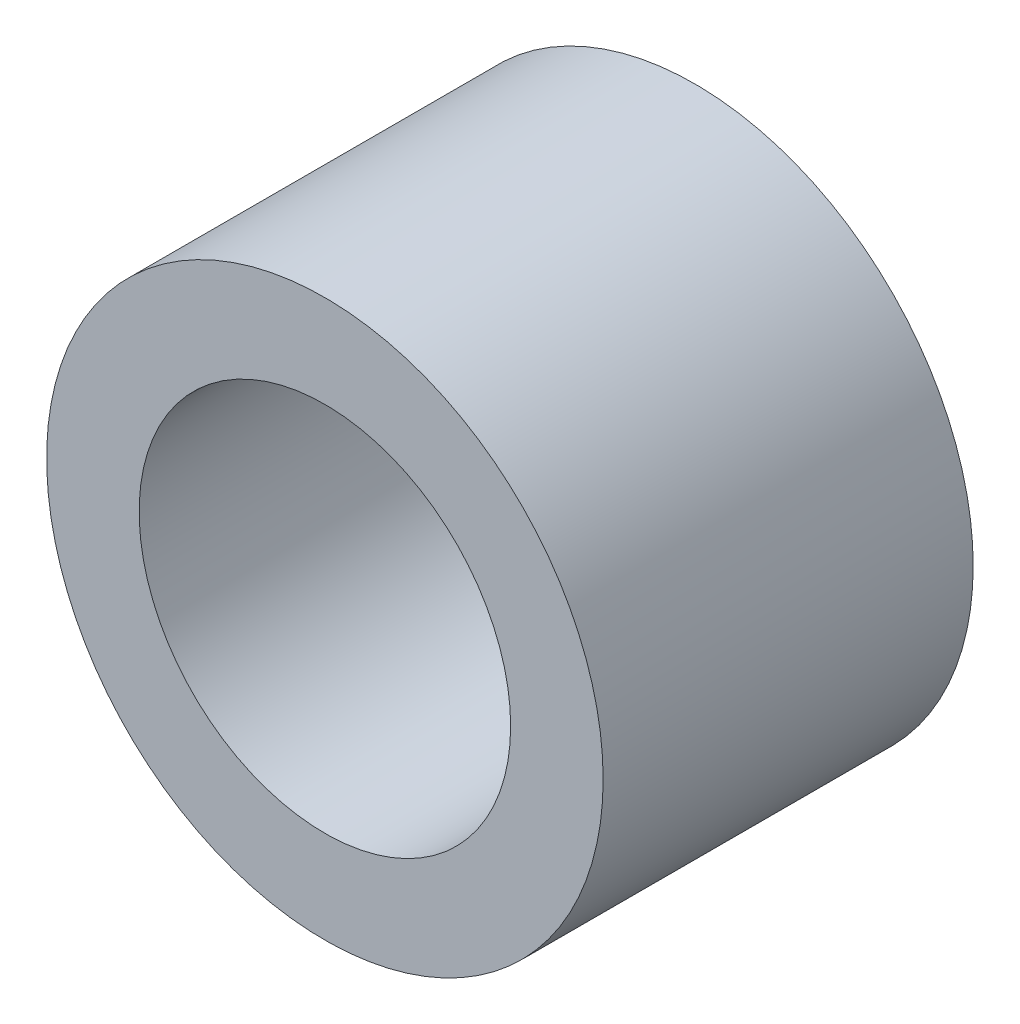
from build123d import *

# Parameters (mm, degrees)
BOSS_EXTRUDE1_DEPTH      = 3.175
BOSS_EXTRUDE1_DEPTH_BACK = 3.175
SKETCH5_R                = 4.7752
SKETCH5_R_2              = 3.1877


with BuildPart() as part:
    # Sketch5 → Boss-Extrude1 (new, two sides: drawn at the far end of the back side and taken through both)
    with BuildSketch(Plane.XY.offset(-BOSS_EXTRUDE1_DEPTH_BACK)):
        Circle(SKETCH5_R)
        Circle(SKETCH5_R_2, mode=Mode.SUBTRACT)
    extrude(amount=BOSS_EXTRUDE1_DEPTH + BOSS_EXTRUDE1_DEPTH_BACK)


solid = part.part
